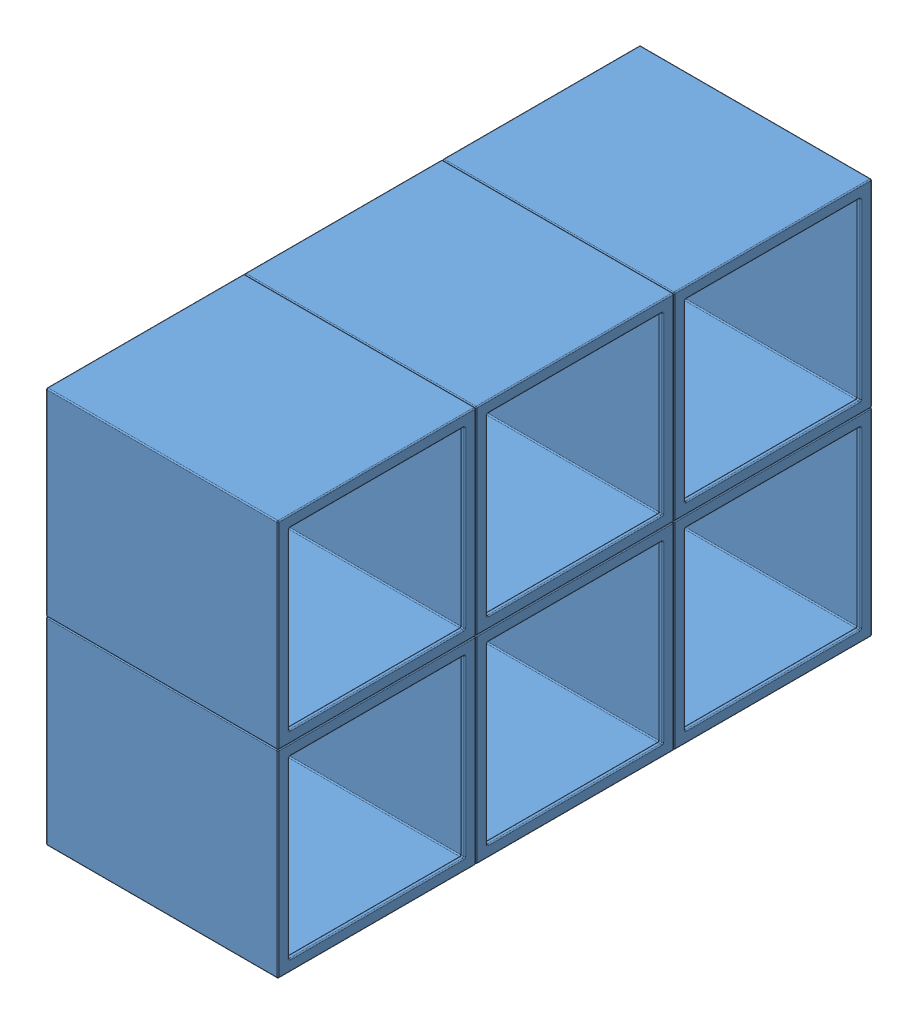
SolidWorks assembly Centrifuge.SLDASM, configuration Default (file format 12000). Lengths in mm.
Overall size (130.18 222.25 333.38).
6 component instances, 1 part files, 18 mates.
Components (placement in the parent):
- Tissue Box-1: Tissue Box.SLDPRT [Default] at (0 111.125 0) x (0 -1 0) z (0 0 1) size (111.12 130.18 111.12)
- Tissue Box-2: Tissue Box.SLDPRT [Default] at (0 222.25 0) x (0 -1 0) z (0 0 1) size (111.12 130.18 111.12)
- Tissue Box-3: Tissue Box.SLDPRT [Default] at (0 111.125 -111.125) x (0 -1 0) z (0 0 1) size (111.12 130.18 111.12)
- Tissue Box-4: Tissue Box.SLDPRT [Default] at (0 111.125 -222.25) x (0 -1 0) z (0 0 1) size (111.12 130.18 111.12)
- Tissue Box-5: Tissue Box.SLDPRT [Default] at (0 222.25 -222.25) x (0 -1 0) z (0 0 1) size (111.12 130.18 111.12)
- Tissue Box-6: Tissue Box.SLDPRT [Default] at (0 222.25 -111.125) x (0 -1 0) z (0 0 1) size (111.12 130.18 111.12)
Mates (geometry in assembly coordinates):
- Coincident1: coincident anti-aligned: plane of Tissue Box-1 through (130.175 0 0) normal (0 -1 0)
- Coincident2: coincident aligned: plane of Tissue Box-1 through (130.175 111.125 0) normal (0 0 1)
- Coincident3: coincident anti-aligned: plane of Tissue Box-1 through (0 111.125 0) normal (-1 0 0)
- Coincident4: coincident aligned: plane of Tissue Box-1 through (0 111.125 0) normal (-1 0 0); plane of Tissue Box-2 through (0 222.25 0) normal (-1 0 0)
- Coincident5: coincident aligned: plane of Tissue Box-3 through (0 111.125 -111.125) normal (-1 0 0); plane of Tissue Box-6 through (0 222.25 -111.125) normal (-1 0 0)
- Coincident6: coincident aligned: plane of Tissue Box-4 through (0 111.125 -222.25) normal (-1 0 0); plane of Tissue Box-5 through (0 222.25 -222.25) normal (-1 0 0)
- Coincident7: coincident aligned: plane of Tissue Box-4 through (0 111.125 -222.25) normal (-1 0 0); plane of Tissue Box-6 through (0 222.25 -111.125) normal (-1 0 0)
- Coincident8: coincident aligned: plane of Tissue Box-2 through (0 222.25 0) normal (-1 0 0); plane of Tissue Box-4 through (0 111.125 -222.25) normal (-1 0 0)
- Coincident9: coincident anti-aligned: plane of Tissue Box-1 through (130.175 111.125 0) normal (0 1 0); plane of Tissue Box-2 through (130.175 111.125 0) normal (0 -1 0)
- Coincident10: coincident aligned: plane of Tissue Box-1 through (130.175 111.125 0) normal (0 0 1); plane of Tissue Box-2 through (130.175 222.25 0) normal (0 0 1)
- Coincident11: coincident aligned: plane of Tissue Box-3 through (130.175 111.125 -111.125) normal (0 0 1); plane of Tissue Box-6 through (130.175 222.25 -111.125) normal (0 0 1)
- Coincident12: coincident anti-aligned: plane of Tissue Box-3 through (130.175 111.125 -111.125) normal (0 1 0); plane of Tissue Box-6 through (130.175 111.125 -111.125) normal (0 -1 0)
- Coincident13: coincident anti-aligned: plane of Tissue Box-1 through (130.175 111.125 -111.125) normal (0 0 -1); plane of Tissue Box-3 through (130.175 111.125 -111.125) normal (0 0 1)
- Coincident14: coincident aligned: plane of Tissue Box-2 through (130.175 222.25 0) normal (0 1 0); plane of Tissue Box-6 through (130.175 222.25 -111.125) normal (0 1 0)
- Coincident15: coincident anti-aligned: plane of Tissue Box-5 through (130.175 222.25 -222.25) normal (0 0 1); plane of Tissue Box-6 through (130.175 222.25 -222.25) normal (0 0 -1)
- Coincident16: coincident aligned: plane of Tissue Box-5 through (130.175 222.25 -222.25) normal (0 1 0); plane of Tissue Box-6 through (130.175 222.25 -111.125) normal (0 1 0)
- Coincident17: coincident anti-aligned: plane of Tissue Box-4 through (130.175 111.125 -222.25) normal (0 1 0); plane of Tissue Box-5 through (130.175 111.125 -222.25) normal (0 -1 0)
- Coincident18: coincident aligned: plane of Tissue Box-4 through (130.175 111.125 -333.375) normal (0 0 -1); plane of Tissue Box-5 through (130.175 222.25 -333.375) normal (0 0 -1)
